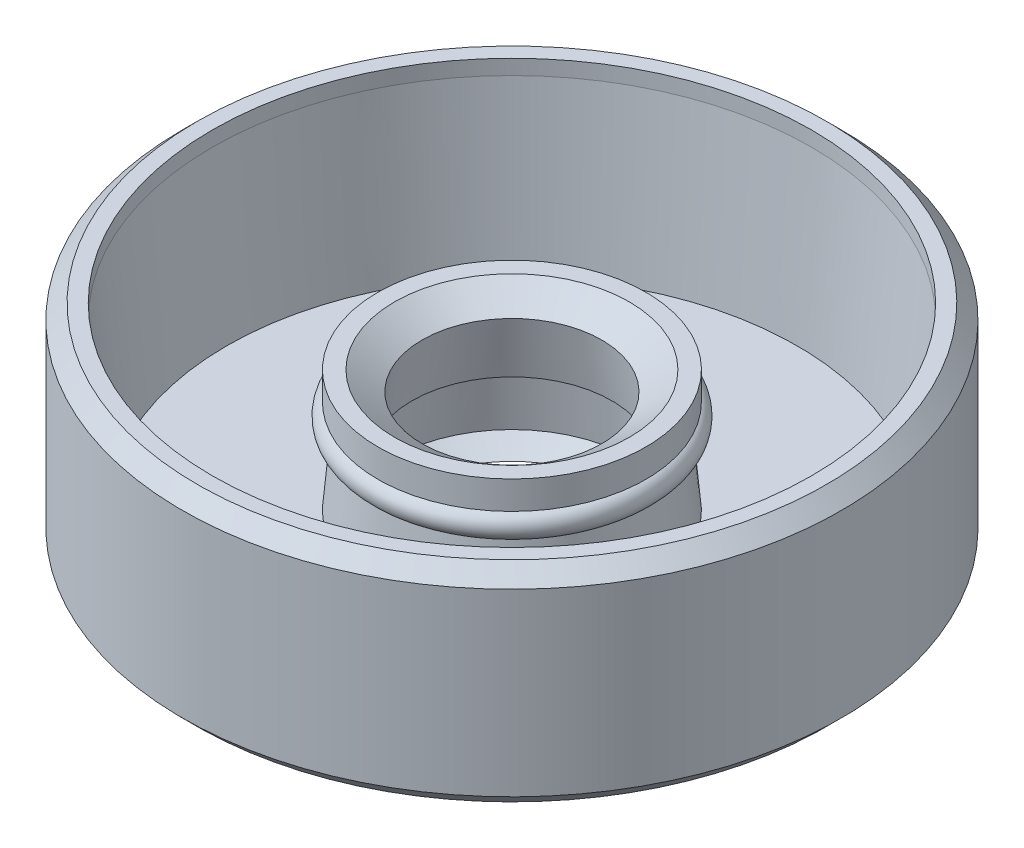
ISO-10303-21;
HEADER;
FILE_DESCRIPTION(('STEP AP214'),'2;1');
FILE_NAME('part.step','',(''),(''),'','','');
FILE_SCHEMA(('AUTOMOTIVE_DESIGN { 1 0 10303 214 1 1 1 1 }'));
ENDSEC;
DATA;
#1=APPLICATION_CONTEXT('core data for automotive mechanical design processes');
#2=APPLICATION_PROTOCOL_DEFINITION('international standard','automotive_design',2000,#1);
#3=PRODUCT_CONTEXT('',#1,'mechanical');
#4=PRODUCT('Part','Part','',(#3));
#5=PRODUCT_RELATED_PRODUCT_CATEGORY('part','',(#4));
#6=PRODUCT_DEFINITION_FORMATION('','',#4);
#7=PRODUCT_DEFINITION_CONTEXT('part definition',#1,'design');
#8=PRODUCT_DEFINITION('design','',#6,#7);
#9=PRODUCT_DEFINITION_SHAPE('','',#8);
#10=(LENGTH_UNIT() NAMED_UNIT(*) SI_UNIT(.MILLI.,.METRE.));
#11=(NAMED_UNIT(*) PLANE_ANGLE_UNIT() SI_UNIT($,.RADIAN.));
#12=(NAMED_UNIT(*) SI_UNIT($,.STERADIAN.) SOLID_ANGLE_UNIT());
#13=UNCERTAINTY_MEASURE_WITH_UNIT(LENGTH_MEASURE(1.E-05),#10,'distance_accuracy_value','');
#14=(GEOMETRIC_REPRESENTATION_CONTEXT(3) GLOBAL_UNCERTAINTY_ASSIGNED_CONTEXT((#13)) GLOBAL_UNIT_ASSIGNED_CONTEXT((#10,
#11,#12)) REPRESENTATION_CONTEXT('',''));
#15=CARTESIAN_POINT('',(0.,0.,0.));
#16=DIRECTION('',(0.,0.,1.));
#17=DIRECTION('',(1.,0.,0.));
#18=AXIS2_PLACEMENT_3D('',#15,#16,#17);
#19=CARTESIAN_POINT('',(0.,0.5,0.));
#20=DIRECTION('',(0.,1.,0.));
#21=DIRECTION('',(-1.,0.,0.));
#22=AXIS2_PLACEMENT_3D('',#19,#20,#21);
#23=CONICAL_SURFACE('',#22,11.,0.785398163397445);
#24=CARTESIAN_POINT('',(0.,0.,0.));
#25=DIRECTION('',(0.,1.,0.));
#26=DIRECTION('',(-1.,0.,0.));
#27=AXIS2_PLACEMENT_3D('',#24,#25,#26);
#28=CIRCLE('',#27,10.5);
#29=CARTESIAN_POINT('',(-10.5,0.,0.));
#30=VERTEX_POINT('',#29);
#31=EDGE_CURVE('E10',#30,#30,#28,.T.);
#32=ORIENTED_EDGE('',*,*,#31,.T.);
#33=EDGE_LOOP('',(#32));
#34=FACE_BOUND('',#33,.T.);
#35=CARTESIAN_POINT('',(0.,0.5,0.));
#36=DIRECTION('',(0.,1.,0.));
#37=DIRECTION('',(-1.,0.,0.));
#38=AXIS2_PLACEMENT_3D('',#35,#36,#37);
#39=CIRCLE('',#38,11.);
#40=CARTESIAN_POINT('',(-11.,0.499999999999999,0.));
#41=VERTEX_POINT('',#40);
#42=EDGE_CURVE('E93',#41,#41,#39,.T.);
#43=ORIENTED_EDGE('',*,*,#42,.F.);
#44=EDGE_LOOP('',(#43));
#45=FACE_BOUND('',#44,.T.);
#46=ADVANCED_FACE('F29',(#34,#45),#23,.T.);
#47=CARTESIAN_POINT('',(-10.5,0.,0.));
#48=DIRECTION('',(0.,-1.,0.));
#49=DIRECTION('',(1.,0.,0.));
#50=AXIS2_PLACEMENT_3D('',#47,#48,#49);
#51=PLANE('',#50);
#52=CARTESIAN_POINT('',(0.,0.,0.));
#53=DIRECTION('',(0.,1.,0.));
#54=DIRECTION('',(-1.,0.,0.));
#55=AXIS2_PLACEMENT_3D('',#52,#53,#54);
#56=CIRCLE('',#55,4.47320209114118);
#57=CARTESIAN_POINT('',(-4.47320209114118,0.,0.));
#58=VERTEX_POINT('',#57);
#59=EDGE_CURVE('E35',#58,#58,#56,.T.);
#60=ORIENTED_EDGE('',*,*,#59,.T.);
#61=EDGE_LOOP('',(#60));
#62=FACE_BOUND('',#61,.T.);
#63=ORIENTED_EDGE('',*,*,#31,.F.);
#64=EDGE_LOOP('',(#63));
#65=FACE_BOUND('',#64,.T.);
#66=ADVANCED_FACE('F101',(#62,#65),#51,.T.);
#67=CARTESIAN_POINT('',(0.,5.97733576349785,0.));
#68=DIRECTION('',(0.,1.,0.));
#69=DIRECTION('',(-1.,0.,0.));
#70=AXIS2_PLACEMENT_3D('',#67,#68,#69);
#71=CYLINDRICAL_SURFACE('',#70,4.47320209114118);
#72=CARTESIAN_POINT('',(0.,0.500000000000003,0.));
#73=DIRECTION('',(0.,1.,0.));
#74=DIRECTION('',(-1.,0.,0.));
#75=AXIS2_PLACEMENT_3D('',#72,#73,#74);
#76=CIRCLE('',#75,4.47320209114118);
#77=CARTESIAN_POINT('',(-4.47320209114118,0.500000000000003,0.));
#78=VERTEX_POINT('',#77);
#79=EDGE_CURVE('E39',#78,#78,#76,.T.);
#80=ORIENTED_EDGE('',*,*,#79,.T.);
#81=EDGE_LOOP('',(#80));
#82=FACE_BOUND('',#81,.T.);
#83=ORIENTED_EDGE('',*,*,#59,.F.);
#84=EDGE_LOOP('',(#83));
#85=FACE_BOUND('',#84,.T.);
#86=ADVANCED_FACE('F105',(#82,#85),#71,.F.);
#87=CARTESIAN_POINT('',(0.,0.500000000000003,0.));
#88=DIRECTION('',(0.,1.,0.));
#89=DIRECTION('',(-1.,0.,0.));
#90=AXIS2_PLACEMENT_3D('',#87,#88,#89);
#91=CONICAL_SURFACE('',#90,4.47320209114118,0.741764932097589);
#92=CARTESIAN_POINT('',(0.,0.,0.));
#93=DIRECTION('',(0.,1.,0.));
#94=DIRECTION('',(-1.,0.,0.));
#95=AXIS2_PLACEMENT_3D('',#92,#93,#94);
#96=CIRCLE('',#95,4.01503650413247);
#97=CARTESIAN_POINT('',(-4.01503650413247,0.,0.));
#98=VERTEX_POINT('',#97);
#99=EDGE_CURVE('E43',#98,#98,#96,.T.);
#100=ORIENTED_EDGE('',*,*,#99,.T.);
#101=EDGE_LOOP('',(#100));
#102=FACE_BOUND('',#101,.T.);
#103=ORIENTED_EDGE('',*,*,#79,.F.);
#104=EDGE_LOOP('',(#103));
#105=FACE_BOUND('',#104,.T.);
#106=ADVANCED_FACE('F109',(#102,#105),#91,.T.);
#107=CARTESIAN_POINT('',(0.,0.,0.));
#108=DIRECTION('',(0.,-1.,0.));
#109=DIRECTION('',(1.,0.,0.));
#110=AXIS2_PLACEMENT_3D('',#107,#108,#109);
#111=CONICAL_SURFACE('',#110,4.01503650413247,1.48352986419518);
#112=CARTESIAN_POINT('',(0.,0.0590528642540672,0.));
#113=DIRECTION('',(0.,1.,0.));
#114=DIRECTION('',(-1.,0.,0.));
#115=AXIS2_PLACEMENT_3D('',#112,#113,#114);
#116=CIRCLE('',#115,3.34005917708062);
#117=CARTESIAN_POINT('',(-3.34005917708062,0.0590528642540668,0.));
#118=VERTEX_POINT('',#117);
#119=EDGE_CURVE('E48',#118,#118,#116,.T.);
#120=ORIENTED_EDGE('',*,*,#119,.T.);
#121=EDGE_LOOP('',(#120));
#122=FACE_BOUND('',#121,.T.);
#123=ORIENTED_EDGE('',*,*,#99,.F.);
#124=EDGE_LOOP('',(#123));
#125=FACE_BOUND('',#124,.T.);
#126=ADVANCED_FACE('F116',(#122,#125),#111,.F.);
#127=CARTESIAN_POINT('',(0.,0.0590528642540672,0.));
#128=DIRECTION('',(0.,1.,0.));
#129=DIRECTION('',(-1.,0.,0.));
#130=AXIS2_PLACEMENT_3D('',#127,#128,#129);
#131=CONICAL_SURFACE('',#130,3.34005917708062,0.992120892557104);
#132=CARTESIAN_POINT('',(0.,0.500000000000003,0.));
#133=DIRECTION('',(0.,1.,0.));
#134=DIRECTION('',(-1.,0.,0.));
#135=AXIS2_PLACEMENT_3D('',#132,#133,#134);
#136=CIRCLE('',#135,4.01503650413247);
#137=CARTESIAN_POINT('',(-4.01503650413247,0.500000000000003,0.));
#138=VERTEX_POINT('',#137);
#139=EDGE_CURVE('E51',#138,#138,#136,.T.);
#140=ORIENTED_EDGE('',*,*,#139,.T.);
#141=EDGE_LOOP('',(#140));
#142=FACE_BOUND('',#141,.T.);
#143=ORIENTED_EDGE('',*,*,#119,.F.);
#144=EDGE_LOOP('',(#143));
#145=FACE_BOUND('',#144,.T.);
#146=ADVANCED_FACE('F120',(#142,#145),#131,.F.);
#147=CARTESIAN_POINT('',(0.,0.500000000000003,0.));
#148=DIRECTION('',(0.,-1.,0.));
#149=DIRECTION('',(1.,0.,0.));
#150=AXIS2_PLACEMENT_3D('',#147,#148,#149);
#151=CONICAL_SURFACE('',#150,4.01503650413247,0.0872664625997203);
#152=CARTESIAN_POINT('',(0.,2.50000000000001,0.));
#153=DIRECTION('',(0.,1.,0.));
#154=DIRECTION('',(-1.,0.,0.));
#155=AXIS2_PLACEMENT_3D('',#152,#153,#154);
#156=CIRCLE('',#155,3.84005917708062);
#157=CARTESIAN_POINT('',(-3.84005917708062,2.50000000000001,0.));
#158=VERTEX_POINT('',#157);
#159=EDGE_CURVE('E54',#158,#158,#156,.T.);
#160=ORIENTED_EDGE('',*,*,#159,.T.);
#161=EDGE_LOOP('',(#160));
#162=FACE_BOUND('',#161,.T.);
#163=ORIENTED_EDGE('',*,*,#139,.F.);
#164=EDGE_LOOP('',(#163));
#165=FACE_BOUND('',#164,.T.);
#166=ADVANCED_FACE('F124',(#162,#165),#151,.F.);
#167=CARTESIAN_POINT('',(-3.34005917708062,2.50000000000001,0.));
#168=DIRECTION('',(0.,-1.,0.));
#169=DIRECTION('',(1.,0.,0.));
#170=AXIS2_PLACEMENT_3D('',#167,#168,#169);
#171=PLANE('',#170);
#172=CARTESIAN_POINT('',(0.,2.50000000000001,0.));
#173=DIRECTION('',(0.,1.,0.));
#174=DIRECTION('',(-1.,0.,0.));
#175=AXIS2_PLACEMENT_3D('',#172,#173,#174);
#176=CIRCLE('',#175,3.34005917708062);
#177=CARTESIAN_POINT('',(-3.34005917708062,2.50000000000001,0.));
#178=VERTEX_POINT('',#177);
#179=EDGE_CURVE('E57',#178,#178,#176,.T.);
#180=ORIENTED_EDGE('',*,*,#179,.T.);
#181=EDGE_LOOP('',(#180));
#182=FACE_BOUND('',#181,.T.);
#183=ORIENTED_EDGE('',*,*,#159,.F.);
#184=EDGE_LOOP('',(#183));
#185=FACE_BOUND('',#184,.T.);
#186=ADVANCED_FACE('F128',(#182,#185),#171,.T.);
#187=CARTESIAN_POINT('',(0.,2.50000000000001,0.));
#188=DIRECTION('',(0.,-1.,0.));
#189=DIRECTION('',(1.,0.,0.));
#190=AXIS2_PLACEMENT_3D('',#187,#188,#189);
#191=CONICAL_SURFACE('',#190,3.34005917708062,0.174532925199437);
#192=CARTESIAN_POINT('',(0.,4.42857142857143,0.));
#193=DIRECTION('',(0.,1.,0.));
#194=DIRECTION('',(-1.,0.,0.));
#195=AXIS2_PLACEMENT_3D('',#192,#193,#194);
#196=CIRCLE('',#195,3.);
#197=CARTESIAN_POINT('',(-3.,4.42857142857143,0.));
#198=VERTEX_POINT('',#197);
#199=EDGE_CURVE('E60',#198,#198,#196,.T.);
#200=ORIENTED_EDGE('',*,*,#199,.T.);
#201=EDGE_LOOP('',(#200));
#202=FACE_BOUND('',#201,.T.);
#203=ORIENTED_EDGE('',*,*,#179,.F.);
#204=EDGE_LOOP('',(#203));
#205=FACE_BOUND('',#204,.T.);
#206=ADVANCED_FACE('F132',(#202,#205),#191,.F.);
#207=CARTESIAN_POINT('',(0.,4.42857142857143,0.));
#208=DIRECTION('',(0.,1.,0.));
#209=DIRECTION('',(-1.,0.,0.));
#210=AXIS2_PLACEMENT_3D('',#207,#208,#209);
#211=CONICAL_SURFACE('',#210,3.,0.95993108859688);
#212=CARTESIAN_POINT('',(0.,5.07142857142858,0.));
#213=DIRECTION('',(0.,1.,0.));
#214=DIRECTION('',(-1.,0.,0.));
#215=AXIS2_PLACEMENT_3D('',#212,#213,#214);
#216=CIRCLE('',#215,3.91809514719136);
#217=CARTESIAN_POINT('',(-3.91809514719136,5.07142857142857,0.));
#218=VERTEX_POINT('',#217);
#219=EDGE_CURVE('E63',#218,#218,#216,.T.);
#220=ORIENTED_EDGE('',*,*,#219,.T.);
#221=EDGE_LOOP('',(#220));
#222=FACE_BOUND('',#221,.T.);
#223=ORIENTED_EDGE('',*,*,#199,.F.);
#224=EDGE_LOOP('',(#223));
#225=FACE_BOUND('',#224,.T.);
#226=ADVANCED_FACE('F136',(#222,#225),#211,.F.);
#227=CARTESIAN_POINT('',(-3.91809514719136,5.07142857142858,0.));
#228=DIRECTION('',(0.,1.,0.));
#229=DIRECTION('',(-1.,0.,0.));
#230=AXIS2_PLACEMENT_3D('',#227,#228,#229);
#231=PLANE('',#230);
#232=CARTESIAN_POINT('',(0.,5.07142857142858,0.));
#233=DIRECTION('',(0.,1.,0.));
#234=DIRECTION('',(-1.,0.,0.));
#235=AXIS2_PLACEMENT_3D('',#232,#233,#234);
#236=CIRCLE('',#235,4.47320209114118);
#237=CARTESIAN_POINT('',(-4.47320209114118,5.07142857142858,0.));
#238=VERTEX_POINT('',#237);
#239=EDGE_CURVE('E66',#238,#238,#236,.T.);
#240=ORIENTED_EDGE('',*,*,#239,.T.);
#241=EDGE_LOOP('',(#240));
#242=FACE_BOUND('',#241,.T.);
#243=ORIENTED_EDGE('',*,*,#219,.F.);
#244=EDGE_LOOP('',(#243));
#245=FACE_BOUND('',#244,.T.);
#246=ADVANCED_FACE('F140',(#242,#245),#231,.T.);
#247=CARTESIAN_POINT('',(0.,5.97733576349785,0.));
#248=DIRECTION('',(0.,1.,0.));
#249=DIRECTION('',(-1.,0.,0.));
#250=AXIS2_PLACEMENT_3D('',#247,#248,#249);
#251=CYLINDRICAL_SURFACE('',#250,4.47320209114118);
#252=CARTESIAN_POINT('',(0.,4.13322405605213,0.));
#253=DIRECTION('',(0.,1.,0.));
#254=DIRECTION('',(-1.,0.,0.));
#255=AXIS2_PLACEMENT_3D('',#252,#253,#254);
#256=CIRCLE('',#255,4.47320209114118);
#257=CARTESIAN_POINT('',(-4.47320209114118,4.13322405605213,0.));
#258=VERTEX_POINT('',#257);
#259=EDGE_CURVE('E69',#258,#258,#256,.T.);
#260=ORIENTED_EDGE('',*,*,#259,.T.);
#261=EDGE_LOOP('',(#260));
#262=FACE_BOUND('',#261,.T.);
#263=ORIENTED_EDGE('',*,*,#239,.F.);
#264=EDGE_LOOP('',(#263));
#265=FACE_BOUND('',#264,.T.);
#266=ADVANCED_FACE('F144',(#262,#265),#251,.T.);
#267=CARTESIAN_POINT('',(0.,3.73322405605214,0.));
#268=DIRECTION('',(0.,1.,0.));
#269=DIRECTION('',(-1.,0.,0.));
#270=AXIS2_PLACEMENT_3D('',#267,#268,#269);
#271=TOROIDAL_SURFACE('',#270,4.27320209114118,0.447213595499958);
#272=CARTESIAN_POINT('',(0.,3.28601046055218,0.));
#273=DIRECTION('',(0.,1.,0.));
#274=DIRECTION('',(-1.,0.,0.));
#275=AXIS2_PLACEMENT_3D('',#272,#273,#274);
#276=CIRCLE('',#275,4.27320209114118);
#277=CARTESIAN_POINT('',(-4.27320209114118,3.28601046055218,0.));
#278=VERTEX_POINT('',#277);
#279=EDGE_CURVE('E72',#278,#278,#276,.T.);
#280=ORIENTED_EDGE('',*,*,#279,.T.);
#281=EDGE_LOOP('',(#280));
#282=FACE_BOUND('',#281,.T.);
#283=ORIENTED_EDGE('',*,*,#259,.F.);
#284=EDGE_LOOP('',(#283));
#285=FACE_BOUND('',#284,.T.);
#286=ADVANCED_FACE('F148',(#282,#285),#271,.T.);
#287=CARTESIAN_POINT('',(0.,3.28601046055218,0.));
#288=DIRECTION('',(0.,-1.,0.));
#289=DIRECTION('',(1.,0.,0.));
#290=AXIS2_PLACEMENT_3D('',#287,#288,#289);
#291=CONICAL_SURFACE('',#290,4.27320209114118,0.0872664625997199);
#292=CARTESIAN_POINT('',(0.,1.,0.));
#293=DIRECTION('',(0.,1.,0.));
#294=DIRECTION('',(-1.,0.,0.));
#295=AXIS2_PLACEMENT_3D('',#292,#293,#294);
#296=CIRCLE('',#295,4.47320209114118);
#297=CARTESIAN_POINT('',(-4.47320209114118,1.,0.));
#298=VERTEX_POINT('',#297);
#299=EDGE_CURVE('E75',#298,#298,#296,.T.);
#300=ORIENTED_EDGE('',*,*,#299,.T.);
#301=EDGE_LOOP('',(#300));
#302=FACE_BOUND('',#301,.T.);
#303=ORIENTED_EDGE('',*,*,#279,.F.);
#304=EDGE_LOOP('',(#303));
#305=FACE_BOUND('',#304,.T.);
#306=ADVANCED_FACE('F152',(#302,#305),#291,.T.);
#307=CARTESIAN_POINT('',(-9.51881235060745,1.,0.));
#308=DIRECTION('',(0.,1.,0.));
#309=DIRECTION('',(-1.,0.,0.));
#310=AXIS2_PLACEMENT_3D('',#307,#308,#309);
#311=PLANE('',#310);
#312=CARTESIAN_POINT('',(0.,1.,0.));
#313=DIRECTION('',(0.,1.,0.));
#314=DIRECTION('',(-1.,0.,0.));
#315=AXIS2_PLACEMENT_3D('',#312,#313,#314);
#316=CIRCLE('',#315,9.51881235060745);
#317=CARTESIAN_POINT('',(-9.51881235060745,0.999999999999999,0.));
#318=VERTEX_POINT('',#317);
#319=EDGE_CURVE('E78',#318,#318,#316,.T.);
#320=ORIENTED_EDGE('',*,*,#319,.T.);
#321=EDGE_LOOP('',(#320));
#322=FACE_BOUND('',#321,.T.);
#323=ORIENTED_EDGE('',*,*,#299,.F.);
#324=EDGE_LOOP('',(#323));
#325=FACE_BOUND('',#324,.T.);
#326=ADVANCED_FACE('F156',(#322,#325),#311,.T.);
#327=CARTESIAN_POINT('',(0.,1.,0.));
#328=DIRECTION('',(0.,1.,0.));
#329=DIRECTION('',(-1.,0.,0.));
#330=AXIS2_PLACEMENT_3D('',#327,#328,#329);
#331=CONICAL_SURFACE('',#330,9.51881235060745,0.0872664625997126);
#332=CARTESIAN_POINT('',(0.,6.50000000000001,0.));
#333=DIRECTION('',(0.,1.,0.));
#334=DIRECTION('',(-1.,0.,0.));
#335=AXIS2_PLACEMENT_3D('',#332,#333,#334);
#336=CIRCLE('',#335,10.);
#337=CARTESIAN_POINT('',(-10.,6.50000000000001,0.));
#338=VERTEX_POINT('',#337);
#339=EDGE_CURVE('E81',#338,#338,#336,.T.);
#340=ORIENTED_EDGE('',*,*,#339,.T.);
#341=EDGE_LOOP('',(#340));
#342=FACE_BOUND('',#341,.T.);
#343=ORIENTED_EDGE('',*,*,#319,.F.);
#344=EDGE_LOOP('',(#343));
#345=FACE_BOUND('',#344,.T.);
#346=ADVANCED_FACE('F160',(#342,#345),#331,.F.);
#347=CARTESIAN_POINT('',(0.,5.97733576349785,0.));
#348=DIRECTION('',(0.,1.,0.));
#349=DIRECTION('',(-1.,0.,0.));
#350=AXIS2_PLACEMENT_3D('',#347,#348,#349);
#351=CYLINDRICAL_SURFACE('',#350,10.);
#352=CARTESIAN_POINT('',(0.,7.00000000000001,0.));
#353=DIRECTION('',(0.,1.,0.));
#354=DIRECTION('',(-1.,0.,0.));
#355=AXIS2_PLACEMENT_3D('',#352,#353,#354);
#356=CIRCLE('',#355,10.);
#357=CARTESIAN_POINT('',(-10.,7.00000000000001,0.));
#358=VERTEX_POINT('',#357);
#359=EDGE_CURVE('E84',#358,#358,#356,.T.);
#360=ORIENTED_EDGE('',*,*,#359,.T.);
#361=EDGE_LOOP('',(#360));
#362=FACE_BOUND('',#361,.T.);
#363=ORIENTED_EDGE('',*,*,#339,.F.);
#364=EDGE_LOOP('',(#363));
#365=FACE_BOUND('',#364,.T.);
#366=ADVANCED_FACE('F164',(#362,#365),#351,.F.);
#367=CARTESIAN_POINT('',(-10.,7.00000000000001,0.));
#368=DIRECTION('',(0.,1.,0.));
#369=DIRECTION('',(-1.,0.,0.));
#370=AXIS2_PLACEMENT_3D('',#367,#368,#369);
#371=PLANE('',#370);
#372=CARTESIAN_POINT('',(0.,7.00000000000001,0.));
#373=DIRECTION('',(0.,1.,0.));
#374=DIRECTION('',(-1.,0.,0.));
#375=AXIS2_PLACEMENT_3D('',#372,#373,#374);
#376=CIRCLE('',#375,10.5);
#377=CARTESIAN_POINT('',(-10.5,7.00000000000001,0.));
#378=VERTEX_POINT('',#377);
#379=EDGE_CURVE('E87',#378,#378,#376,.T.);
#380=ORIENTED_EDGE('',*,*,#379,.T.);
#381=EDGE_LOOP('',(#380));
#382=FACE_BOUND('',#381,.T.);
#383=ORIENTED_EDGE('',*,*,#359,.F.);
#384=EDGE_LOOP('',(#383));
#385=FACE_BOUND('',#384,.T.);
#386=ADVANCED_FACE('F168',(#382,#385),#371,.T.);
#387=CARTESIAN_POINT('',(0.,7.00000000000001,0.));
#388=DIRECTION('',(0.,-1.,0.));
#389=DIRECTION('',(1.,0.,0.));
#390=AXIS2_PLACEMENT_3D('',#387,#388,#389);
#391=CONICAL_SURFACE('',#390,10.5,0.785398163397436);
#392=CARTESIAN_POINT('',(0.,6.50000000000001,0.));
#393=DIRECTION('',(0.,1.,0.));
#394=DIRECTION('',(-1.,0.,0.));
#395=AXIS2_PLACEMENT_3D('',#392,#393,#394);
#396=CIRCLE('',#395,11.);
#397=CARTESIAN_POINT('',(-11.,6.50000000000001,0.));
#398=VERTEX_POINT('',#397);
#399=EDGE_CURVE('E90',#398,#398,#396,.T.);
#400=ORIENTED_EDGE('',*,*,#399,.T.);
#401=EDGE_LOOP('',(#400));
#402=FACE_BOUND('',#401,.T.);
#403=ORIENTED_EDGE('',*,*,#379,.F.);
#404=EDGE_LOOP('',(#403));
#405=FACE_BOUND('',#404,.T.);
#406=ADVANCED_FACE('F172',(#402,#405),#391,.T.);
#407=CARTESIAN_POINT('',(0.,5.97733576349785,0.));
#408=DIRECTION('',(0.,1.,0.));
#409=DIRECTION('',(-1.,0.,0.));
#410=AXIS2_PLACEMENT_3D('',#407,#408,#409);
#411=CYLINDRICAL_SURFACE('',#410,11.);
#412=ORIENTED_EDGE('',*,*,#42,.T.);
#413=EDGE_LOOP('',(#412));
#414=FACE_BOUND('',#413,.T.);
#415=ORIENTED_EDGE('',*,*,#399,.F.);
#416=EDGE_LOOP('',(#415));
#417=FACE_BOUND('',#416,.T.);
#418=ADVANCED_FACE('F97',(#414,#417),#411,.T.);
#419=CLOSED_SHELL('',(#46,#66,#86,#106,#126,#146,#166,#186,#206,#226,#246,#266,#286,#306,#326,
#346,#366,#386,#406,#418));
#420=MANIFOLD_SOLID_BREP('B2',#419);
#421=ADVANCED_BREP_SHAPE_REPRESENTATION('',(#18,#420),#14);
#422=SHAPE_DEFINITION_REPRESENTATION(#9,#421);
ENDSEC;
END-ISO-10303-21;
